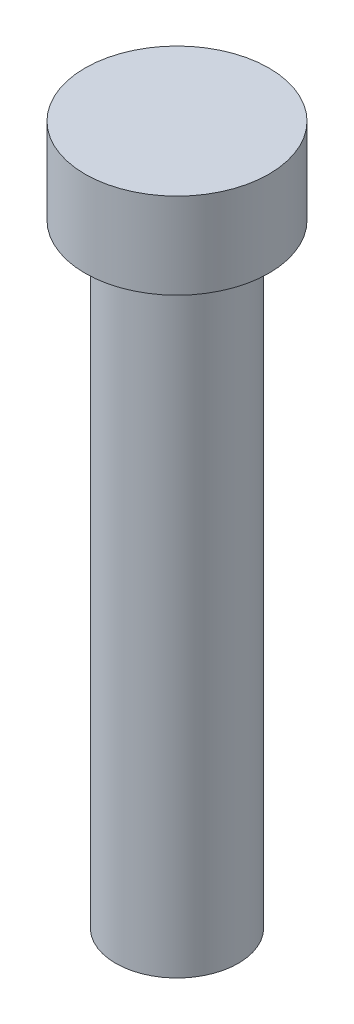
from build123d import *

# Parameters (mm, degrees)
SKETCH1_R           = 5
BOSS_EXTRUDE1_DEPTH = 50
SKETCH2_R           = 7.5
BOSS_EXTRUDE2_DEPTH = 7


with BuildPart() as part:
    # Sketch1 → Boss-Extrude1 (new body)
    with BuildSketch(Plane(origin=(0, 0, 0), x_dir=(1, 0, 0), z_dir=(0, 1, 0))):
        with Locations(Location((0, 0, 0), (0, 0, 270))):
            Circle(SKETCH1_R)
    extrude(amount=BOSS_EXTRUDE1_DEPTH)

    # Sketch2 → Boss-Extrude2 (add)
    with BuildSketch(Plane(origin=(0, 50, 0), x_dir=(1, 0, 0), z_dir=(0, 1, 0))):
        with Locations(Location((0, 0, 0), (0, 0, 270))):
            Circle(SKETCH2_R)
    extrude(amount=BOSS_EXTRUDE2_DEPTH)


solid = part.part
